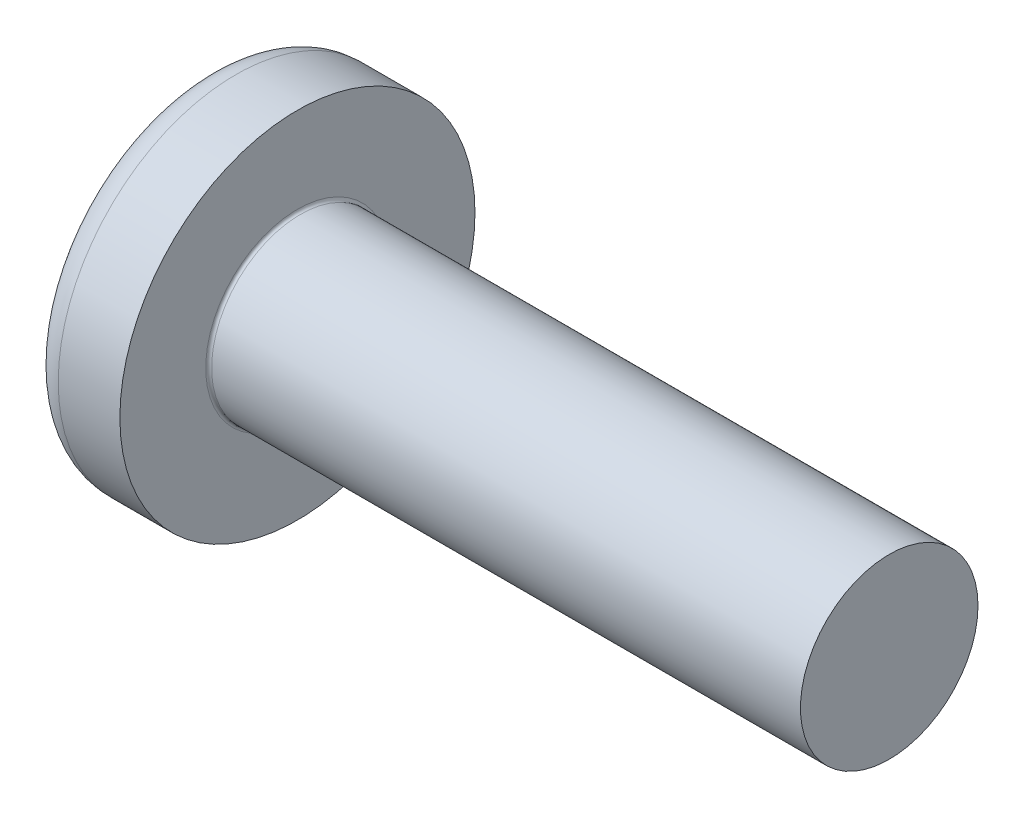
ISO-10303-21;
HEADER;
FILE_DESCRIPTION(('STEP AP214'),'2;1');
FILE_NAME('part.step','',(''),(''),'','','');
FILE_SCHEMA(('AUTOMOTIVE_DESIGN { 1 0 10303 214 1 1 1 1 }'));
ENDSEC;
DATA;
#1=APPLICATION_CONTEXT('core data for automotive mechanical design processes');
#2=APPLICATION_PROTOCOL_DEFINITION('international standard','automotive_design',2000,#1);
#3=PRODUCT_CONTEXT('',#1,'mechanical');
#4=PRODUCT('Part','Part','',(#3));
#5=PRODUCT_RELATED_PRODUCT_CATEGORY('part','',(#4));
#6=PRODUCT_DEFINITION_FORMATION('','',#4);
#7=PRODUCT_DEFINITION_CONTEXT('part definition',#1,'design');
#8=PRODUCT_DEFINITION('design','',#6,#7);
#9=PRODUCT_DEFINITION_SHAPE('','',#8);
#10=(LENGTH_UNIT() NAMED_UNIT(*) SI_UNIT(.MILLI.,.METRE.));
#11=(NAMED_UNIT(*) PLANE_ANGLE_UNIT() SI_UNIT($,.RADIAN.));
#12=(NAMED_UNIT(*) SI_UNIT($,.STERADIAN.) SOLID_ANGLE_UNIT());
#13=UNCERTAINTY_MEASURE_WITH_UNIT(LENGTH_MEASURE(1.E-05),#10,'distance_accuracy_value','');
#14=(GEOMETRIC_REPRESENTATION_CONTEXT(3) GLOBAL_UNCERTAINTY_ASSIGNED_CONTEXT((#13)) GLOBAL_UNIT_ASSIGNED_CONTEXT((#10,
#11,#12)) REPRESENTATION_CONTEXT('',''));
#15=CARTESIAN_POINT('',(0.,0.,0.));
#16=DIRECTION('',(0.,0.,1.));
#17=DIRECTION('',(1.,0.,0.));
#18=AXIS2_PLACEMENT_3D('',#15,#16,#17);
#19=CARTESIAN_POINT('',(10.,0.,0.));
#20=DIRECTION('',(-1.,0.,0.));
#21=DIRECTION('',(0.,-1.,0.));
#22=AXIS2_PLACEMENT_3D('',#19,#20,#21);
#23=SPHERICAL_SURFACE('',#22,10.);
#24=CARTESIAN_POINT('',(1.68520580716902,0.,0.));
#25=DIRECTION('',(1.,0.,0.));
#26=DIRECTION('',(0.,0.,-1.));
#27=AXIS2_PLACEMENT_3D('',#24,#25,#26);
#28=CIRCLE('',#27,5.55555555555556);
#29=CARTESIAN_POINT('',(1.68520580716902,0.,-5.55555555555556));
#30=VERTEX_POINT('',#29);
#31=EDGE_CURVE('E45',#30,#30,#28,.F.);
#32=ORIENTED_EDGE('',*,*,#31,.T.);
#33=EDGE_LOOP('',(#32));
#34=FACE_BOUND('',#33,.T.);
#35=CARTESIAN_POINT('',(10.,-2.075,0.));
#36=DIRECTION('',(0.,1.,0.));
#37=DIRECTION('',(0.,0.,1.));
#38=AXIS2_PLACEMENT_3D('',#35,#36,#37);
#39=CIRCLE('',#38,9.78235017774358);
#40=CARTESIAN_POINT('',(0.291283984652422,-2.075,1.19800180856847));
#41=VERTEX_POINT('',#40);
#42=CARTESIAN_POINT('',(0.291283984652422,-2.075,-1.19800180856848));
#43=VERTEX_POINT('',#42);
#44=EDGE_CURVE('E151',#41,#43,#39,.F.);
#45=ORIENTED_EDGE('',*,*,#44,.T.);
#46=CARTESIAN_POINT('',(10.,-1.0375,-1.79700271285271));
#47=DIRECTION('',(0.,0.5,0.866025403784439));
#48=DIRECTION('',(0.,-0.866025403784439,0.5));
#49=AXIS2_PLACEMENT_3D('',#46,#47,#48);
#50=CIRCLE('',#49,9.78235017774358);
#51=CARTESIAN_POINT('',(0.29128398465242,0.,-2.39600361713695));
#52=VERTEX_POINT('',#51);
#53=EDGE_CURVE('E161',#43,#52,#50,.F.);
#54=ORIENTED_EDGE('',*,*,#53,.T.);
#55=CARTESIAN_POINT('',(10.,1.0375,-1.79700271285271));
#56=DIRECTION('',(0.,-0.5,0.866025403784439));
#57=DIRECTION('',(0.,-0.866025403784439,-0.5));
#58=AXIS2_PLACEMENT_3D('',#55,#56,#57);
#59=CIRCLE('',#58,9.78235017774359);
#60=CARTESIAN_POINT('',(0.29128398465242,2.075,-1.19800180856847));
#61=VERTEX_POINT('',#60);
#62=EDGE_CURVE('E60',#52,#61,#59,.F.);
#63=ORIENTED_EDGE('',*,*,#62,.T.);
#64=CARTESIAN_POINT('',(10.,2.075,0.));
#65=DIRECTION('',(0.,-1.,0.));
#66=DIRECTION('',(0.,0.,-1.));
#67=AXIS2_PLACEMENT_3D('',#64,#65,#66);
#68=CIRCLE('',#67,9.78235017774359);
#69=CARTESIAN_POINT('',(0.29128398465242,2.075,1.19800180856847));
#70=VERTEX_POINT('',#69);
#71=EDGE_CURVE('E158',#61,#70,#68,.F.);
#72=ORIENTED_EDGE('',*,*,#71,.T.);
#73=CARTESIAN_POINT('',(10.,1.0375,1.79700271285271));
#74=DIRECTION('',(0.,-0.5,-0.866025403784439));
#75=DIRECTION('',(0.,0.866025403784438,-0.5));
#76=AXIS2_PLACEMENT_3D('',#73,#74,#75);
#77=CIRCLE('',#76,9.78235017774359);
#78=CARTESIAN_POINT('',(0.29128398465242,0.,2.39600361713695));
#79=VERTEX_POINT('',#78);
#80=EDGE_CURVE('E128',#70,#79,#77,.F.);
#81=ORIENTED_EDGE('',*,*,#80,.T.);
#82=CARTESIAN_POINT('',(10.,-1.0375,1.79700271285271));
#83=DIRECTION('',(0.,0.5,-0.866025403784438));
#84=DIRECTION('',(0.,0.866025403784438,0.5));
#85=AXIS2_PLACEMENT_3D('',#82,#83,#84);
#86=CIRCLE('',#85,9.78235017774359);
#87=EDGE_CURVE('E154',#79,#41,#86,.F.);
#88=ORIENTED_EDGE('',*,*,#87,.T.);
#89=EDGE_LOOP('',(#45,#54,#63,#72,#81,#88));
#90=FACE_BOUND('',#89,.T.);
#91=ADVANCED_FACE('F37',(#34,#90),#23,.T.);
#92=CARTESIAN_POINT('',(4.6,0.,0.));
#93=DIRECTION('',(-1.,0.,0.));
#94=DIRECTION('',(0.,0.,1.));
#95=AXIS2_PLACEMENT_3D('',#92,#93,#94);
#96=CYLINDRICAL_SURFACE('',#95,6.);
#97=CARTESIAN_POINT('',(2.51668522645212,0.,0.));
#98=DIRECTION('',(1.,0.,0.));
#99=DIRECTION('',(0.,0.,-1.));
#100=AXIS2_PLACEMENT_3D('',#97,#98,#99);
#101=CIRCLE('',#100,6.);
#102=CARTESIAN_POINT('',(2.51668522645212,0.,-6.));
#103=VERTEX_POINT('',#102);
#104=EDGE_CURVE('E11',#103,#103,#101,.T.);
#105=ORIENTED_EDGE('',*,*,#104,.T.);
#106=EDGE_LOOP('',(#105));
#107=FACE_BOUND('',#106,.T.);
#108=CARTESIAN_POINT('',(4.6,0.,0.));
#109=DIRECTION('',(1.,0.,0.));
#110=DIRECTION('',(0.,0.,-1.));
#111=AXIS2_PLACEMENT_3D('',#108,#109,#110);
#112=CIRCLE('',#111,6.);
#113=CARTESIAN_POINT('',(4.6,0.,-6.));
#114=VERTEX_POINT('',#113);
#115=EDGE_CURVE('E141',#114,#114,#112,.T.);
#116=ORIENTED_EDGE('',*,*,#115,.F.);
#117=EDGE_LOOP('',(#116));
#118=FACE_BOUND('',#117,.T.);
#119=ADVANCED_FACE('F177',(#107,#118),#96,.T.);
#120=CARTESIAN_POINT('',(4.6,0.,0.));
#121=DIRECTION('',(1.,0.,0.));
#122=DIRECTION('',(0.,0.,-1.));
#123=AXIS2_PLACEMENT_3D('',#120,#121,#122);
#124=PLANE('',#123);
#125=CARTESIAN_POINT('',(4.6,0.,0.));
#126=DIRECTION('',(1.,0.,0.));
#127=DIRECTION('',(0.,0.,-1.));
#128=AXIS2_PLACEMENT_3D('',#125,#126,#127);
#129=CIRCLE('',#128,3.1);
#130=CARTESIAN_POINT('',(4.6,0.,-3.1));
#131=VERTEX_POINT('',#130);
#132=EDGE_CURVE('E148',#131,#131,#129,.F.);
#133=ORIENTED_EDGE('',*,*,#132,.T.);
#134=EDGE_LOOP('',(#133));
#135=FACE_BOUND('',#134,.T.);
#136=ORIENTED_EDGE('',*,*,#115,.T.);
#137=EDGE_LOOP('',(#136));
#138=FACE_BOUND('',#137,.T.);
#139=ADVANCED_FACE('F182',(#135,#138),#124,.T.);
#140=CARTESIAN_POINT('',(24.6,0.,0.));
#141=DIRECTION('',(-1.,0.,0.));
#142=DIRECTION('',(0.,0.,1.));
#143=AXIS2_PLACEMENT_3D('',#140,#141,#142);
#144=CYLINDRICAL_SURFACE('',#143,3.);
#145=CARTESIAN_POINT('',(4.7,0.,0.));
#146=DIRECTION('',(1.,0.,0.));
#147=DIRECTION('',(0.,0.,-1.));
#148=AXIS2_PLACEMENT_3D('',#145,#146,#147);
#149=CIRCLE('',#148,3.);
#150=CARTESIAN_POINT('',(4.7,0.,-3.));
#151=VERTEX_POINT('',#150);
#152=EDGE_CURVE('E145',#151,#151,#149,.T.);
#153=ORIENTED_EDGE('',*,*,#152,.T.);
#154=EDGE_LOOP('',(#153));
#155=FACE_BOUND('',#154,.T.);
#156=CARTESIAN_POINT('',(24.6,0.,0.));
#157=DIRECTION('',(1.,0.,0.));
#158=DIRECTION('',(0.,0.,-1.));
#159=AXIS2_PLACEMENT_3D('',#156,#157,#158);
#160=CIRCLE('',#159,3.);
#161=CARTESIAN_POINT('',(24.6,0.,-3.));
#162=VERTEX_POINT('',#161);
#163=EDGE_CURVE('E138',#162,#162,#160,.T.);
#164=ORIENTED_EDGE('',*,*,#163,.F.);
#165=EDGE_LOOP('',(#164));
#166=FACE_BOUND('',#165,.T.);
#167=ADVANCED_FACE('F193',(#155,#166),#144,.T.);
#168=CARTESIAN_POINT('',(24.6,0.,0.));
#169=DIRECTION('',(1.,0.,0.));
#170=DIRECTION('',(0.,0.,-1.));
#171=AXIS2_PLACEMENT_3D('',#168,#169,#170);
#172=PLANE('',#171);
#173=ORIENTED_EDGE('',*,*,#163,.T.);
#174=EDGE_LOOP('',(#173));
#175=FACE_BOUND('',#174,.T.);
#176=ADVANCED_FACE('F189',(#175),#172,.T.);
#177=CARTESIAN_POINT('',(4.7,0.,0.));
#178=DIRECTION('',(1.,0.,0.));
#179=DIRECTION('',(0.,0.,-1.));
#180=AXIS2_PLACEMENT_3D('',#177,#178,#179);
#181=TOROIDAL_SURFACE('',#180,3.1,0.1);
#182=ORIENTED_EDGE('',*,*,#132,.F.);
#183=EDGE_LOOP('',(#182));
#184=FACE_BOUND('',#183,.T.);
#185=ORIENTED_EDGE('',*,*,#152,.F.);
#186=EDGE_LOOP('',(#185));
#187=FACE_BOUND('',#186,.T.);
#188=ADVANCED_FACE('F192',(#184,#187),#181,.F.);
#189=CARTESIAN_POINT('',(2.,-2.075,-1.19800180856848));
#190=DIRECTION('',(0.,0.5,0.866025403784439));
#191=DIRECTION('',(0.,-0.866025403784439,0.5));
#192=AXIS2_PLACEMENT_3D('',#189,#190,#191);
#193=PLANE('',#192);
#194=DIRECTION('',(-1.,0.,0.));
#195=VECTOR('',#194,1.);
#196=CARTESIAN_POINT('',(2.,-2.075,-1.19800180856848));
#197=LINE('',#196,#195);
#198=CARTESIAN_POINT('',(2.,-2.075,-1.19800180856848));
#199=VERTEX_POINT('',#198);
#200=EDGE_CURVE('E52',#199,#43,#197,.T.);
#201=ORIENTED_EDGE('',*,*,#200,.F.);
#202=DIRECTION('',(0.,0.866025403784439,-0.5));
#203=VECTOR('',#202,1.);
#204=CARTESIAN_POINT('',(2.,-2.075,-1.19800180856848));
#205=LINE('',#204,#203);
#206=CARTESIAN_POINT('',(2.,0.,-2.39600361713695));
#207=VERTEX_POINT('',#206);
#208=EDGE_CURVE('E220',#199,#207,#205,.T.);
#209=ORIENTED_EDGE('',*,*,#208,.T.);
#210=DIRECTION('',(-1.,0.,0.));
#211=VECTOR('',#210,1.);
#212=CARTESIAN_POINT('',(2.,0.,-2.39600361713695));
#213=LINE('',#212,#211);
#214=EDGE_CURVE('E131',#207,#52,#213,.T.);
#215=ORIENTED_EDGE('',*,*,#214,.T.);
#216=ORIENTED_EDGE('',*,*,#53,.F.);
#217=EDGE_LOOP('',(#201,#209,#215,#216));
#218=FACE_BOUND('',#217,.T.);
#219=ADVANCED_FACE('F187',(#218),#193,.T.);
#220=CARTESIAN_POINT('',(2.,0.,-2.39600361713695));
#221=DIRECTION('',(0.,-0.5,0.866025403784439));
#222=DIRECTION('',(0.,-0.866025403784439,-0.5));
#223=AXIS2_PLACEMENT_3D('',#220,#221,#222);
#224=PLANE('',#223);
#225=ORIENTED_EDGE('',*,*,#214,.F.);
#226=DIRECTION('',(0.,0.866025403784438,0.5));
#227=VECTOR('',#226,1.);
#228=CARTESIAN_POINT('',(2.,0.,-2.39600361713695));
#229=LINE('',#228,#227);
#230=CARTESIAN_POINT('',(2.,2.075,-1.19800180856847));
#231=VERTEX_POINT('',#230);
#232=EDGE_CURVE('E124',#207,#231,#229,.T.);
#233=ORIENTED_EDGE('',*,*,#232,.T.);
#234=DIRECTION('',(-1.,0.,0.));
#235=VECTOR('',#234,1.);
#236=CARTESIAN_POINT('',(2.,2.075,-1.19800180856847));
#237=LINE('',#236,#235);
#238=EDGE_CURVE('E123',#231,#61,#237,.T.);
#239=ORIENTED_EDGE('',*,*,#238,.T.);
#240=ORIENTED_EDGE('',*,*,#62,.F.);
#241=EDGE_LOOP('',(#225,#233,#239,#240));
#242=FACE_BOUND('',#241,.T.);
#243=ADVANCED_FACE('F205',(#242),#224,.T.);
#244=CARTESIAN_POINT('',(2.,2.075,-1.19800180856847));
#245=DIRECTION('',(0.,-1.,0.));
#246=DIRECTION('',(0.,0.,-1.));
#247=AXIS2_PLACEMENT_3D('',#244,#245,#246);
#248=PLANE('',#247);
#249=ORIENTED_EDGE('',*,*,#238,.F.);
#250=DIRECTION('',(0.,0.,1.));
#251=VECTOR('',#250,1.);
#252=CARTESIAN_POINT('',(2.,2.075,-1.19800180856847));
#253=LINE('',#252,#251);
#254=CARTESIAN_POINT('',(2.,2.075,1.19800180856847));
#255=VERTEX_POINT('',#254);
#256=EDGE_CURVE('E100',#231,#255,#253,.T.);
#257=ORIENTED_EDGE('',*,*,#256,.T.);
#258=DIRECTION('',(-1.,0.,0.));
#259=VECTOR('',#258,1.);
#260=CARTESIAN_POINT('',(2.,2.075,1.19800180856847));
#261=LINE('',#260,#259);
#262=EDGE_CURVE('E121',#255,#70,#261,.T.);
#263=ORIENTED_EDGE('',*,*,#262,.T.);
#264=ORIENTED_EDGE('',*,*,#71,.F.);
#265=EDGE_LOOP('',(#249,#257,#263,#264));
#266=FACE_BOUND('',#265,.T.);
#267=ADVANCED_FACE('F120',(#266),#248,.T.);
#268=CARTESIAN_POINT('',(2.,2.075,1.19800180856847));
#269=DIRECTION('',(0.,-0.5,-0.866025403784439));
#270=DIRECTION('',(0.,0.866025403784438,-0.5));
#271=AXIS2_PLACEMENT_3D('',#268,#269,#270);
#272=PLANE('',#271);
#273=ORIENTED_EDGE('',*,*,#262,.F.);
#274=DIRECTION('',(0.,-0.866025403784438,0.5));
#275=VECTOR('',#274,1.);
#276=CARTESIAN_POINT('',(2.,2.075,1.19800180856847));
#277=LINE('',#276,#275);
#278=CARTESIAN_POINT('',(2.,0.,2.39600361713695));
#279=VERTEX_POINT('',#278);
#280=EDGE_CURVE('E107',#255,#279,#277,.T.);
#281=ORIENTED_EDGE('',*,*,#280,.T.);
#282=DIRECTION('',(-1.,0.,0.));
#283=VECTOR('',#282,1.);
#284=CARTESIAN_POINT('',(2.,0.,2.39600361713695));
#285=LINE('',#284,#283);
#286=EDGE_CURVE('E129',#279,#79,#285,.T.);
#287=ORIENTED_EDGE('',*,*,#286,.T.);
#288=ORIENTED_EDGE('',*,*,#80,.F.);
#289=EDGE_LOOP('',(#273,#281,#287,#288));
#290=FACE_BOUND('',#289,.T.);
#291=ADVANCED_FACE('F126',(#290),#272,.T.);
#292=CARTESIAN_POINT('',(2.,0.,2.39600361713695));
#293=DIRECTION('',(0.,0.5,-0.866025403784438));
#294=DIRECTION('',(0.,0.866025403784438,0.5));
#295=AXIS2_PLACEMENT_3D('',#292,#293,#294);
#296=PLANE('',#295);
#297=ORIENTED_EDGE('',*,*,#286,.F.);
#298=DIRECTION('',(0.,-0.866025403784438,-0.5));
#299=VECTOR('',#298,1.);
#300=CARTESIAN_POINT('',(2.,0.,2.39600361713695));
#301=LINE('',#300,#299);
#302=CARTESIAN_POINT('',(2.,-2.075,1.19800180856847));
#303=VERTEX_POINT('',#302);
#304=EDGE_CURVE('E115',#279,#303,#301,.T.);
#305=ORIENTED_EDGE('',*,*,#304,.T.);
#306=DIRECTION('',(-1.,0.,0.));
#307=VECTOR('',#306,1.);
#308=CARTESIAN_POINT('',(2.,-2.075,1.19800180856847));
#309=LINE('',#308,#307);
#310=EDGE_CURVE('E133',#303,#41,#309,.T.);
#311=ORIENTED_EDGE('',*,*,#310,.T.);
#312=ORIENTED_EDGE('',*,*,#87,.F.);
#313=EDGE_LOOP('',(#297,#305,#311,#312));
#314=FACE_BOUND('',#313,.T.);
#315=ADVANCED_FACE('F244',(#314),#296,.T.);
#316=CARTESIAN_POINT('',(2.,-2.075,1.19800180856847));
#317=DIRECTION('',(0.,1.,0.));
#318=DIRECTION('',(0.,0.,1.));
#319=AXIS2_PLACEMENT_3D('',#316,#317,#318);
#320=PLANE('',#319);
#321=ORIENTED_EDGE('',*,*,#310,.F.);
#322=DIRECTION('',(0.,0.,-1.));
#323=VECTOR('',#322,1.);
#324=CARTESIAN_POINT('',(2.,-2.075,1.19800180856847));
#325=LINE('',#324,#323);
#326=EDGE_CURVE('E221',#303,#199,#325,.T.);
#327=ORIENTED_EDGE('',*,*,#326,.T.);
#328=ORIENTED_EDGE('',*,*,#200,.T.);
#329=ORIENTED_EDGE('',*,*,#44,.F.);
#330=EDGE_LOOP('',(#321,#327,#328,#329));
#331=FACE_BOUND('',#330,.T.);
#332=ADVANCED_FACE('F242',(#331),#320,.T.);
#333=CARTESIAN_POINT('',(2.,2.075,1.19800180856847));
#334=DIRECTION('',(0.86602540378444,0.249999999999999,0.433012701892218));
#335=DIRECTION('',(0.447213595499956,0.,-0.894427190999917));
#336=AXIS2_PLACEMENT_3D('',#333,#334,#335);
#337=PLANE('',#336);
#338=ORIENTED_EDGE('',*,*,#280,.F.);
#339=DIRECTION('',(-0.447213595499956,0.774596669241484,0.447213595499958));
#340=VECTOR('',#339,1.);
#341=CARTESIAN_POINT('',(2.,2.075,1.19800180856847));
#342=LINE('',#341,#340);
#343=CARTESIAN_POINT('',(3.19800180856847,0.,0.));
#344=VERTEX_POINT('',#343);
#345=EDGE_CURVE('E96',#344,#255,#342,.T.);
#346=ORIENTED_EDGE('',*,*,#345,.F.);
#347=DIRECTION('',(-0.447213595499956,0.,0.894427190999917));
#348=VECTOR('',#347,1.);
#349=CARTESIAN_POINT('',(2.,0.,2.39600361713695));
#350=LINE('',#349,#348);
#351=EDGE_CURVE('E109',#344,#279,#350,.T.);
#352=ORIENTED_EDGE('',*,*,#351,.T.);
#353=EDGE_LOOP('',(#338,#346,#352));
#354=FACE_BOUND('',#353,.T.);
#355=ADVANCED_FACE('F108',(#354),#337,.F.);
#356=CARTESIAN_POINT('',(2.,0.,2.39600361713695));
#357=DIRECTION('',(0.86602540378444,-0.249999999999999,0.433012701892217));
#358=DIRECTION('',(0.447213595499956,0.,-0.894427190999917));
#359=AXIS2_PLACEMENT_3D('',#356,#357,#358);
#360=PLANE('',#359);
#361=ORIENTED_EDGE('',*,*,#304,.F.);
#362=ORIENTED_EDGE('',*,*,#351,.F.);
#363=DIRECTION('',(-0.447213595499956,-0.774596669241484,0.447213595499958));
#364=VECTOR('',#363,1.);
#365=CARTESIAN_POINT('',(2.,-2.075,1.19800180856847));
#366=LINE('',#365,#364);
#367=EDGE_CURVE('E231',#344,#303,#366,.T.);
#368=ORIENTED_EDGE('',*,*,#367,.T.);
#369=EDGE_LOOP('',(#361,#362,#368));
#370=FACE_BOUND('',#369,.T.);
#371=ADVANCED_FACE('F246',(#370),#360,.F.);
#372=CARTESIAN_POINT('',(2.,-2.075,1.19800180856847));
#373=DIRECTION('',(0.86602540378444,-0.499999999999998,0.));
#374=DIRECTION('',(0.499999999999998,0.86602540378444,0.));
#375=AXIS2_PLACEMENT_3D('',#372,#373,#374);
#376=PLANE('',#375);
#377=ORIENTED_EDGE('',*,*,#326,.F.);
#378=ORIENTED_EDGE('',*,*,#367,.F.);
#379=DIRECTION('',(-0.447213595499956,-0.774596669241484,-0.447213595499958));
#380=VECTOR('',#379,1.);
#381=CARTESIAN_POINT('',(2.,-2.075,-1.19800180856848));
#382=LINE('',#381,#380);
#383=EDGE_CURVE('E233',#344,#199,#382,.T.);
#384=ORIENTED_EDGE('',*,*,#383,.T.);
#385=EDGE_LOOP('',(#377,#378,#384));
#386=FACE_BOUND('',#385,.T.);
#387=ADVANCED_FACE('F250',(#386),#376,.F.);
#388=CARTESIAN_POINT('',(2.,-2.075,-1.19800180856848));
#389=DIRECTION('',(0.86602540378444,-0.249999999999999,-0.433012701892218));
#390=DIRECTION('',(-0.447213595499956,0.,-0.894427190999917));
#391=AXIS2_PLACEMENT_3D('',#388,#389,#390);
#392=PLANE('',#391);
#393=ORIENTED_EDGE('',*,*,#208,.F.);
#394=ORIENTED_EDGE('',*,*,#383,.F.);
#395=DIRECTION('',(-0.447213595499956,0.,-0.894427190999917));
#396=VECTOR('',#395,1.);
#397=CARTESIAN_POINT('',(2.,0.,-2.39600361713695));
#398=LINE('',#397,#396);
#399=EDGE_CURVE('E235',#344,#207,#398,.T.);
#400=ORIENTED_EDGE('',*,*,#399,.T.);
#401=EDGE_LOOP('',(#393,#394,#400));
#402=FACE_BOUND('',#401,.T.);
#403=ADVANCED_FACE('F252',(#402),#392,.F.);
#404=CARTESIAN_POINT('',(2.,0.,-2.39600361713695));
#405=DIRECTION('',(0.86602540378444,0.249999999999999,-0.433012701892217));
#406=DIRECTION('',(-0.447213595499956,0.,-0.894427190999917));
#407=AXIS2_PLACEMENT_3D('',#404,#405,#406);
#408=PLANE('',#407);
#409=ORIENTED_EDGE('',*,*,#232,.F.);
#410=ORIENTED_EDGE('',*,*,#399,.F.);
#411=DIRECTION('',(-0.447213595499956,0.774596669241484,-0.447213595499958));
#412=VECTOR('',#411,1.);
#413=CARTESIAN_POINT('',(2.,2.075,-1.19800180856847));
#414=LINE('',#413,#412);
#415=EDGE_CURVE('E102',#344,#231,#414,.T.);
#416=ORIENTED_EDGE('',*,*,#415,.T.);
#417=EDGE_LOOP('',(#409,#410,#416));
#418=FACE_BOUND('',#417,.T.);
#419=ADVANCED_FACE('F173',(#418),#408,.F.);
#420=CARTESIAN_POINT('',(2.,2.075,-1.19800180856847));
#421=DIRECTION('',(0.86602540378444,0.499999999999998,0.));
#422=DIRECTION('',(-0.499999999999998,0.86602540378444,0.));
#423=AXIS2_PLACEMENT_3D('',#420,#421,#422);
#424=PLANE('',#423);
#425=ORIENTED_EDGE('',*,*,#256,.F.);
#426=ORIENTED_EDGE('',*,*,#415,.F.);
#427=ORIENTED_EDGE('',*,*,#345,.T.);
#428=EDGE_LOOP('',(#425,#426,#427));
#429=FACE_BOUND('',#428,.T.);
#430=ADVANCED_FACE('F98',(#429),#424,.F.);
#431=CARTESIAN_POINT('',(2.51668522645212,0.,0.));
#432=DIRECTION('',(1.,0.,0.));
#433=DIRECTION('',(0.,0.,-1.));
#434=AXIS2_PLACEMENT_3D('',#431,#432,#433);
#435=TOROIDAL_SURFACE('',#434,5.,1.);
#436=ORIENTED_EDGE('',*,*,#104,.F.);
#437=EDGE_LOOP('',(#436));
#438=FACE_BOUND('',#437,.T.);
#439=ORIENTED_EDGE('',*,*,#31,.F.);
#440=EDGE_LOOP('',(#439));
#441=FACE_BOUND('',#440,.T.);
#442=ADVANCED_FACE('F39',(#438,#441),#435,.T.);
#443=CLOSED_SHELL('',(#91,#119,#139,#167,#176,#188,#219,#243,#267,#291,#315,#332,#355,#371,#387,
#403,#419,#430,#442));
#444=MANIFOLD_SOLID_BREP('B2',#443);
#445=ADVANCED_BREP_SHAPE_REPRESENTATION('',(#18,#444),#14);
#446=SHAPE_DEFINITION_REPRESENTATION(#9,#445);
ENDSEC;
END-ISO-10303-21;
